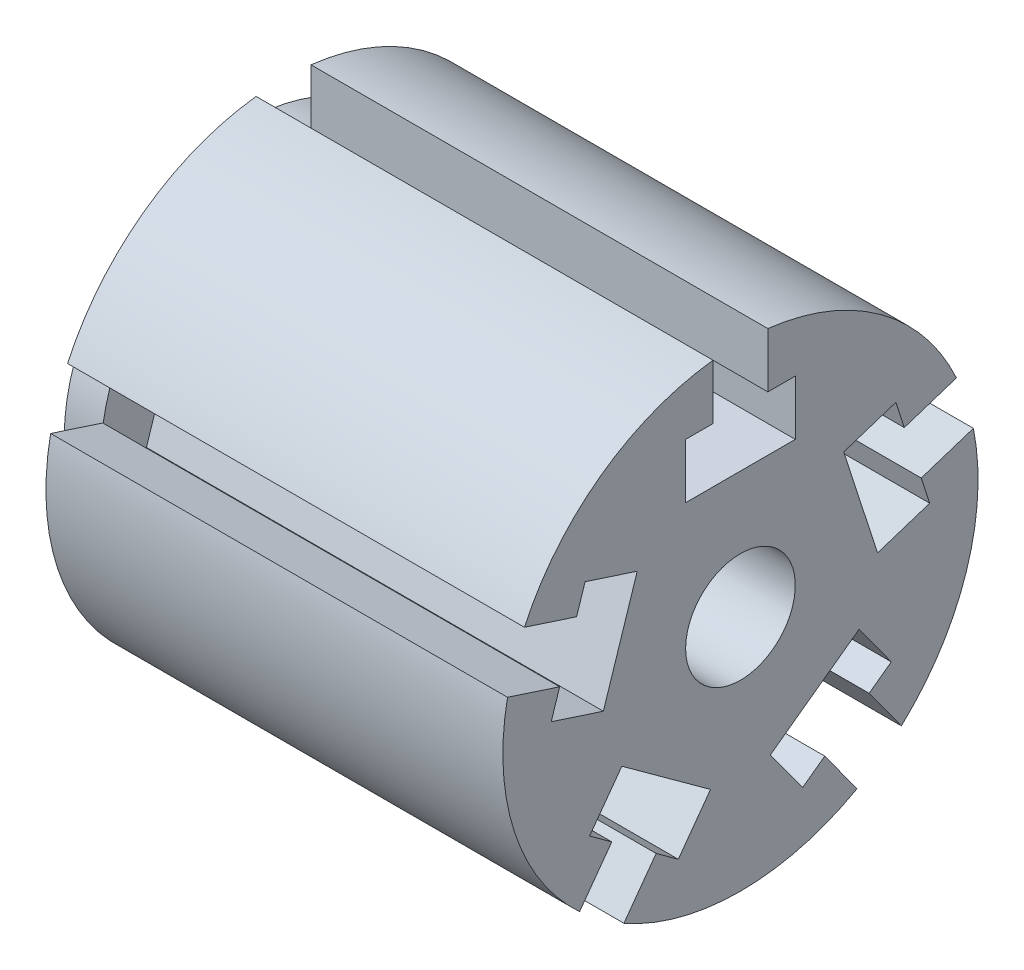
from build123d import *

# Parameters (mm, degrees)
SKETCH1_R           = 13
BOSS_EXTRUDE1_DEPTH = 25
SKETCH2_R           = 10
BOSS_EXTRUDE2_DEPTH = 2
SKETCH3_R           = 3
CUT_EXTRUDE1_DEPTH  = 33.664965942
CUT_EXTRUDE2_START  = -25
CUT_EXTRUDE2_DEPTH  = 25
CIRPATTERN1_COUNT   = 5


with BuildPart() as part:
    # Sketch1 → Boss-Extrude1 (new body)
    with BuildSketch(Plane(origin=(0, 0, 0), x_dir=(0, 0, -1), z_dir=(1, 0, 0))):
        Circle(SKETCH1_R)
    extrude(amount=BOSS_EXTRUDE1_DEPTH)

    # Sketch2 → Boss-Extrude2 (add)
    with BuildSketch(Plane.ZY):
        Circle(SKETCH2_R)
    extrude(amount=BOSS_EXTRUDE2_DEPTH)

    # Sketch3 → Cut-Extrude1 (cut, through all)
    with BuildSketch(Plane.ZY.offset(2)):
        Circle(SKETCH3_R)
    extrude(amount=-CUT_EXTRUDE1_DEPTH, mode=Mode.SUBTRACT)

    # Sketch4 → Cut-Extrude2 (cut)
    with BuildSketch(Plane(origin=(25, 0, 0), x_dir=(0, 0, -1), z_dir=(1, 0, 0)).offset(CUT_EXTRUDE2_START)):
        with BuildLine():
            Line((-1.5, 12.91317157), (-1.5, 9.91317157))
            Line((-1.5, 9.91317157), (-3, 9.91317157))
            Line((-3, 9.91317157), (-3, 6.91317157))
            Line((-3, 6.91317157), (3, 6.91317157))
            Line((3, 6.91317157), (3, 9.91317157))
            Line((3, 9.91317157), (1.5, 9.91317157))
            Line((1.5, 9.91317157), (1.5, 12.91317157))
            ThreePointArc((1.5, 12.91317157), (0, 13), (-1.5, 12.91317157))
        make_face()
    cut_extrude2 = extrude(amount=CUT_EXTRUDE2_DEPTH, mode=Mode.SUBTRACT)

    # CirPattern1: Cut-Extrude2 ×5 about axis
    cirpattern1_axis = Axis((0, 0, 0), (1, 0, 0))
    for i in range(1, CIRPATTERN1_COUNT):
        add(cut_extrude2.rotate(cirpattern1_axis, i * 360 / CIRPATTERN1_COUNT), mode=Mode.SUBTRACT)


solid = part.part
